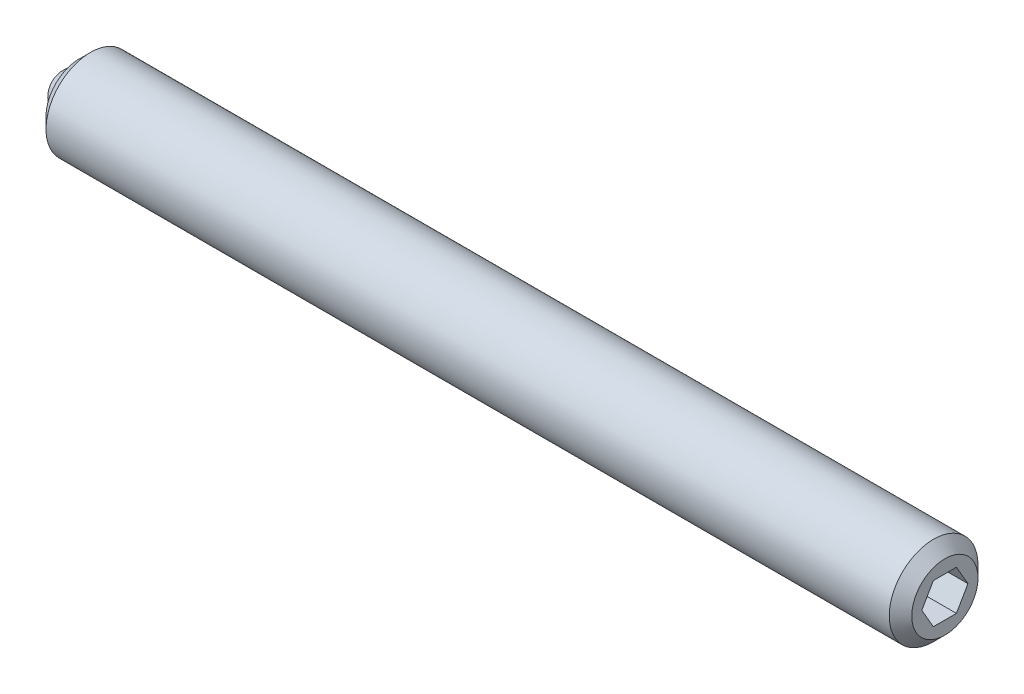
ISO-10303-21;
HEADER;
FILE_DESCRIPTION(('STEP AP214'),'2;1');
FILE_NAME('part.step','',(''),(''),'','','');
FILE_SCHEMA(('AUTOMOTIVE_DESIGN { 1 0 10303 214 1 1 1 1 }'));
ENDSEC;
DATA;
#1=APPLICATION_CONTEXT('core data for automotive mechanical design processes');
#2=APPLICATION_PROTOCOL_DEFINITION('international standard','automotive_design',2000,#1);
#3=PRODUCT_CONTEXT('',#1,'mechanical');
#4=PRODUCT('Part','Part','',(#3));
#5=PRODUCT_RELATED_PRODUCT_CATEGORY('part','',(#4));
#6=PRODUCT_DEFINITION_FORMATION('','',#4);
#7=PRODUCT_DEFINITION_CONTEXT('part definition',#1,'design');
#8=PRODUCT_DEFINITION('design','',#6,#7);
#9=PRODUCT_DEFINITION_SHAPE('','',#8);
#10=(LENGTH_UNIT() NAMED_UNIT(*) SI_UNIT(.MILLI.,.METRE.));
#11=(NAMED_UNIT(*) PLANE_ANGLE_UNIT() SI_UNIT($,.RADIAN.));
#12=(NAMED_UNIT(*) SI_UNIT($,.STERADIAN.) SOLID_ANGLE_UNIT());
#13=UNCERTAINTY_MEASURE_WITH_UNIT(LENGTH_MEASURE(1.E-05),#10,'distance_accuracy_value','');
#14=(GEOMETRIC_REPRESENTATION_CONTEXT(3) GLOBAL_UNCERTAINTY_ASSIGNED_CONTEXT((#13)) GLOBAL_UNIT_ASSIGNED_CONTEXT((#10,
#11,#12)) REPRESENTATION_CONTEXT('',''));
#15=CARTESIAN_POINT('',(0.,0.,0.));
#16=DIRECTION('',(0.,0.,1.));
#17=DIRECTION('',(1.,0.,0.));
#18=AXIS2_PLACEMENT_3D('',#15,#16,#17);
#19=CARTESIAN_POINT('',(0.,0.,0.));
#20=DIRECTION('',(0.,-1.,0.));
#21=DIRECTION('',(0.,0.,-1.));
#22=AXIS2_PLACEMENT_3D('',#19,#20,#21);
#23=SPHERICAL_SURFACE('',#22,0.5);
#24=CARTESIAN_POINT('',(0.,-0.5,0.));
#25=VERTEX_POINT('',#24);
#26=VERTEX_LOOP('',#25);
#27=FACE_BOUND('',#26,.T.);
#28=ADVANCED_FACE('F41',(#27),#23,.T.);
#29=CLOSED_SHELL('',(#28));
#30=MANIFOLD_SOLID_BREP('B2',#29);
#31=CARTESIAN_POINT('',(19.5,0.,0.));
#32=DIRECTION('',(-1.,0.,0.));
#33=DIRECTION('',(0.,0.,1.));
#34=AXIS2_PLACEMENT_3D('',#31,#32,#33);
#35=CYLINDRICAL_SURFACE('',#34,1.);
#36=CARTESIAN_POINT('',(19.246,0.,0.));
#37=DIRECTION('',(1.,0.,0.));
#38=DIRECTION('',(0.,0.,-1.));
#39=AXIS2_PLACEMENT_3D('',#36,#37,#38);
#40=CIRCLE('',#39,1.);
#41=CARTESIAN_POINT('',(19.246,0.,-1.));
#42=VERTEX_POINT('',#41);
#43=EDGE_CURVE('E39',#42,#42,#40,.F.);
#44=ORIENTED_EDGE('',*,*,#43,.T.);
#45=EDGE_LOOP('',(#44));
#46=FACE_BOUND('',#45,.T.);
#47=CARTESIAN_POINT('',(0.253999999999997,0.,0.));
#48=DIRECTION('',(1.,0.,0.));
#49=DIRECTION('',(0.,0.,-1.));
#50=AXIS2_PLACEMENT_3D('',#47,#48,#49);
#51=CIRCLE('',#50,1.);
#52=CARTESIAN_POINT('',(0.253999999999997,0.,-1.));
#53=VERTEX_POINT('',#52);
#54=EDGE_CURVE('E157',#53,#53,#51,.T.);
#55=ORIENTED_EDGE('',*,*,#54,.T.);
#56=EDGE_LOOP('',(#55));
#57=FACE_BOUND('',#56,.T.);
#58=ADVANCED_FACE('F54',(#46,#57),#35,.T.);
#59=CARTESIAN_POINT('',(19.5,0.,0.));
#60=DIRECTION('',(1.,0.,0.));
#61=DIRECTION('',(0.,0.,-1.));
#62=AXIS2_PLACEMENT_3D('',#59,#60,#61);
#63=PLANE('',#62);
#64=DIRECTION('',(0.,0.866025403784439,-0.5));
#65=VECTOR('',#64,1.);
#66=CARTESIAN_POINT('',(19.5,-0.45,-0.259807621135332));
#67=LINE('',#66,#65);
#68=CARTESIAN_POINT('',(19.5,-0.45,-0.259807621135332));
#69=VERTEX_POINT('',#68);
#70=CARTESIAN_POINT('',(19.5,0.,-0.519615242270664));
#71=VERTEX_POINT('',#70);
#72=EDGE_CURVE('E69',#69,#71,#67,.T.);
#73=ORIENTED_EDGE('',*,*,#72,.F.);
#74=DIRECTION('',(0.,0.,-1.));
#75=VECTOR('',#74,1.);
#76=CARTESIAN_POINT('',(19.5,-0.45,0.259807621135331));
#77=LINE('',#76,#75);
#78=CARTESIAN_POINT('',(19.5,-0.45,0.259807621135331));
#79=VERTEX_POINT('',#78);
#80=EDGE_CURVE('E153',#79,#69,#77,.T.);
#81=ORIENTED_EDGE('',*,*,#80,.F.);
#82=DIRECTION('',(0.,-0.866025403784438,-0.5));
#83=VECTOR('',#82,1.);
#84=CARTESIAN_POINT('',(19.5,0.,0.519615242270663));
#85=LINE('',#84,#83);
#86=CARTESIAN_POINT('',(19.5,0.,0.519615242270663));
#87=VERTEX_POINT('',#86);
#88=EDGE_CURVE('E151',#87,#79,#85,.T.);
#89=ORIENTED_EDGE('',*,*,#88,.F.);
#90=DIRECTION('',(0.,-0.866025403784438,0.5));
#91=VECTOR('',#90,1.);
#92=CARTESIAN_POINT('',(19.5,0.45,0.259807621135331));
#93=LINE('',#92,#91);
#94=CARTESIAN_POINT('',(19.5,0.45,0.259807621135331));
#95=VERTEX_POINT('',#94);
#96=EDGE_CURVE('E117',#95,#87,#93,.T.);
#97=ORIENTED_EDGE('',*,*,#96,.F.);
#98=DIRECTION('',(0.,0.,1.));
#99=VECTOR('',#98,1.);
#100=CARTESIAN_POINT('',(19.5,0.45,-0.259807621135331));
#101=LINE('',#100,#99);
#102=CARTESIAN_POINT('',(19.5,0.45,-0.259807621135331));
#103=VERTEX_POINT('',#102);
#104=EDGE_CURVE('E147',#103,#95,#101,.T.);
#105=ORIENTED_EDGE('',*,*,#104,.F.);
#106=DIRECTION('',(0.,0.866025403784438,0.5));
#107=VECTOR('',#106,1.);
#108=CARTESIAN_POINT('',(19.5,0.,-0.519615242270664));
#109=LINE('',#108,#107);
#110=EDGE_CURVE('E143',#71,#103,#109,.T.);
#111=ORIENTED_EDGE('',*,*,#110,.F.);
#112=EDGE_LOOP('',(#73,#81,#89,#97,#105,#111));
#113=FACE_BOUND('',#112,.T.);
#114=CARTESIAN_POINT('',(19.5,0.,0.));
#115=DIRECTION('',(1.,0.,0.));
#116=DIRECTION('',(0.,0.,-1.));
#117=AXIS2_PLACEMENT_3D('',#114,#115,#116);
#118=CIRCLE('',#117,0.746);
#119=CARTESIAN_POINT('',(19.5,0.,-0.746));
#120=VERTEX_POINT('',#119);
#121=EDGE_CURVE('E62',#120,#120,#118,.T.);
#122=ORIENTED_EDGE('',*,*,#121,.T.);
#123=EDGE_LOOP('',(#122));
#124=FACE_BOUND('',#123,.T.);
#125=ADVANCED_FACE('F170',(#113,#124),#63,.T.);
#126=CARTESIAN_POINT('',(0.,0.,0.));
#127=DIRECTION('',(1.,0.,0.));
#128=DIRECTION('',(0.,0.,-1.));
#129=AXIS2_PLACEMENT_3D('',#126,#127,#128);
#130=PLANE('',#129);
#131=CARTESIAN_POINT('',(0.,0.,0.));
#132=DIRECTION('',(-1.,0.,0.));
#133=DIRECTION('',(0.,0.,1.));
#134=AXIS2_PLACEMENT_3D('',#131,#132,#133);
#135=CIRCLE('',#134,0.5);
#136=CARTESIAN_POINT('',(0.,0.,0.5));
#137=VERTEX_POINT('',#136);
#138=EDGE_CURVE('E225',#137,#137,#135,.T.);
#139=ORIENTED_EDGE('',*,*,#138,.F.);
#140=EDGE_LOOP('',(#139));
#141=FACE_BOUND('',#140,.T.);
#142=CARTESIAN_POINT('',(0.,0.,0.));
#143=DIRECTION('',(1.,0.,0.));
#144=DIRECTION('',(0.,0.,-1.));
#145=AXIS2_PLACEMENT_3D('',#142,#143,#144);
#146=CIRCLE('',#145,0.746000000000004);
#147=CARTESIAN_POINT('',(0.,0.,-0.746000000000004));
#148=VERTEX_POINT('',#147);
#149=EDGE_CURVE('E165',#148,#148,#146,.F.);
#150=ORIENTED_EDGE('',*,*,#149,.T.);
#151=EDGE_LOOP('',(#150));
#152=FACE_BOUND('',#151,.T.);
#153=ADVANCED_FACE('F182',(#141,#152),#130,.F.);
#154=CARTESIAN_POINT('',(0.253999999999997,0.,0.));
#155=DIRECTION('',(1.,0.,0.));
#156=DIRECTION('',(0.,0.,-1.));
#157=AXIS2_PLACEMENT_3D('',#154,#155,#156);
#158=CONICAL_SURFACE('',#157,1.,0.785398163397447);
#159=ORIENTED_EDGE('',*,*,#149,.F.);
#160=EDGE_LOOP('',(#159));
#161=FACE_BOUND('',#160,.T.);
#162=ORIENTED_EDGE('',*,*,#54,.F.);
#163=EDGE_LOOP('',(#162));
#164=FACE_BOUND('',#163,.T.);
#165=ADVANCED_FACE('F174',(#161,#164),#158,.T.);
#166=CARTESIAN_POINT('',(19.5,0.,0.));
#167=DIRECTION('',(-1.,0.,0.));
#168=DIRECTION('',(0.,0.,1.));
#169=AXIS2_PLACEMENT_3D('',#166,#167,#168);
#170=CONICAL_SURFACE('',#169,0.746,0.785398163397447);
#171=ORIENTED_EDGE('',*,*,#43,.F.);
#172=EDGE_LOOP('',(#171));
#173=FACE_BOUND('',#172,.T.);
#174=ORIENTED_EDGE('',*,*,#121,.F.);
#175=EDGE_LOOP('',(#174));
#176=FACE_BOUND('',#175,.T.);
#177=ADVANCED_FACE('F56',(#173,#176),#170,.T.);
#178=CARTESIAN_POINT('',(17.5,-0.45,-0.259807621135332));
#179=DIRECTION('',(0.,-0.5,-0.866025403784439));
#180=DIRECTION('',(0.,0.866025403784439,-0.5));
#181=AXIS2_PLACEMENT_3D('',#178,#179,#180);
#182=PLANE('',#181);
#183=ORIENTED_EDGE('',*,*,#72,.T.);
#184=DIRECTION('',(1.,0.,0.));
#185=VECTOR('',#184,1.);
#186=CARTESIAN_POINT('',(17.5,0.,-0.519615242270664));
#187=LINE('',#186,#185);
#188=CARTESIAN_POINT('',(17.5,0.,-0.519615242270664));
#189=VERTEX_POINT('',#188);
#190=EDGE_CURVE('E99',#189,#71,#187,.T.);
#191=ORIENTED_EDGE('',*,*,#190,.F.);
#192=DIRECTION('',(0.,0.866025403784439,-0.5));
#193=VECTOR('',#192,1.);
#194=CARTESIAN_POINT('',(17.5,-0.45,-0.259807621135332));
#195=LINE('',#194,#193);
#196=CARTESIAN_POINT('',(17.5,-0.45,-0.259807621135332));
#197=VERTEX_POINT('',#196);
#198=EDGE_CURVE('E155',#197,#189,#195,.T.);
#199=ORIENTED_EDGE('',*,*,#198,.F.);
#200=DIRECTION('',(1.,0.,0.));
#201=VECTOR('',#200,1.);
#202=CARTESIAN_POINT('',(17.5,-0.45,-0.259807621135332));
#203=LINE('',#202,#201);
#204=EDGE_CURVE('E77',#197,#69,#203,.T.);
#205=ORIENTED_EDGE('',*,*,#204,.T.);
#206=EDGE_LOOP('',(#183,#191,#199,#205));
#207=FACE_BOUND('',#206,.T.);
#208=ADVANCED_FACE('F173',(#207),#182,.F.);
#209=CARTESIAN_POINT('',(17.5,-0.45,0.259807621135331));
#210=DIRECTION('',(0.,-1.,0.));
#211=DIRECTION('',(0.,0.,-1.));
#212=AXIS2_PLACEMENT_3D('',#209,#210,#211);
#213=PLANE('',#212);
#214=ORIENTED_EDGE('',*,*,#80,.T.);
#215=ORIENTED_EDGE('',*,*,#204,.F.);
#216=DIRECTION('',(0.,0.,-1.));
#217=VECTOR('',#216,1.);
#218=CARTESIAN_POINT('',(17.5,-0.45,0.259807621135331));
#219=LINE('',#218,#217);
#220=CARTESIAN_POINT('',(17.5,-0.45,0.259807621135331));
#221=VERTEX_POINT('',#220);
#222=EDGE_CURVE('E129',#221,#197,#219,.T.);
#223=ORIENTED_EDGE('',*,*,#222,.F.);
#224=DIRECTION('',(1.,0.,0.));
#225=VECTOR('',#224,1.);
#226=CARTESIAN_POINT('',(17.5,-0.45,0.259807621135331));
#227=LINE('',#226,#225);
#228=EDGE_CURVE('E121',#221,#79,#227,.T.);
#229=ORIENTED_EDGE('',*,*,#228,.T.);
#230=EDGE_LOOP('',(#214,#215,#223,#229));
#231=FACE_BOUND('',#230,.T.);
#232=ADVANCED_FACE('F180',(#231),#213,.F.);
#233=CARTESIAN_POINT('',(17.5,0.,0.519615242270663));
#234=DIRECTION('',(0.,-0.5,0.866025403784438));
#235=DIRECTION('',(0.,-0.866025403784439,-0.5));
#236=AXIS2_PLACEMENT_3D('',#233,#234,#235);
#237=PLANE('',#236);
#238=ORIENTED_EDGE('',*,*,#88,.T.);
#239=ORIENTED_EDGE('',*,*,#228,.F.);
#240=DIRECTION('',(0.,-0.866025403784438,-0.5));
#241=VECTOR('',#240,1.);
#242=CARTESIAN_POINT('',(17.5,0.,0.519615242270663));
#243=LINE('',#242,#241);
#244=CARTESIAN_POINT('',(17.5,0.,0.519615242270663));
#245=VERTEX_POINT('',#244);
#246=EDGE_CURVE('E125',#245,#221,#243,.T.);
#247=ORIENTED_EDGE('',*,*,#246,.F.);
#248=DIRECTION('',(1.,0.,0.));
#249=VECTOR('',#248,1.);
#250=CARTESIAN_POINT('',(17.5,0.,0.519615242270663));
#251=LINE('',#250,#249);
#252=EDGE_CURVE('E110',#245,#87,#251,.T.);
#253=ORIENTED_EDGE('',*,*,#252,.T.);
#254=EDGE_LOOP('',(#238,#239,#247,#253));
#255=FACE_BOUND('',#254,.T.);
#256=ADVANCED_FACE('F126',(#255),#237,.F.);
#257=CARTESIAN_POINT('',(17.5,0.45,0.259807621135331));
#258=DIRECTION('',(0.,0.5,0.866025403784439));
#259=DIRECTION('',(0.,-0.866025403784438,0.5));
#260=AXIS2_PLACEMENT_3D('',#257,#258,#259);
#261=PLANE('',#260);
#262=ORIENTED_EDGE('',*,*,#96,.T.);
#263=ORIENTED_EDGE('',*,*,#252,.F.);
#264=DIRECTION('',(0.,-0.866025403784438,0.5));
#265=VECTOR('',#264,1.);
#266=CARTESIAN_POINT('',(17.5,0.45,0.259807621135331));
#267=LINE('',#266,#265);
#268=CARTESIAN_POINT('',(17.5,0.45,0.259807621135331));
#269=VERTEX_POINT('',#268);
#270=EDGE_CURVE('E114',#269,#245,#267,.T.);
#271=ORIENTED_EDGE('',*,*,#270,.F.);
#272=DIRECTION('',(1.,0.,0.));
#273=VECTOR('',#272,1.);
#274=CARTESIAN_POINT('',(17.5,0.45,0.259807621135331));
#275=LINE('',#274,#273);
#276=EDGE_CURVE('E122',#269,#95,#275,.T.);
#277=ORIENTED_EDGE('',*,*,#276,.T.);
#278=EDGE_LOOP('',(#262,#263,#271,#277));
#279=FACE_BOUND('',#278,.T.);
#280=ADVANCED_FACE('F112',(#279),#261,.F.);
#281=CARTESIAN_POINT('',(17.5,0.45,-0.259807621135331));
#282=DIRECTION('',(0.,1.,0.));
#283=DIRECTION('',(0.,0.,1.));
#284=AXIS2_PLACEMENT_3D('',#281,#282,#283);
#285=PLANE('',#284);
#286=ORIENTED_EDGE('',*,*,#104,.T.);
#287=ORIENTED_EDGE('',*,*,#276,.F.);
#288=DIRECTION('',(0.,0.,1.));
#289=VECTOR('',#288,1.);
#290=CARTESIAN_POINT('',(17.5,0.45,-0.259807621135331));
#291=LINE('',#290,#289);
#292=CARTESIAN_POINT('',(17.5,0.45,-0.259807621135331));
#293=VERTEX_POINT('',#292);
#294=EDGE_CURVE('E135',#293,#269,#291,.T.);
#295=ORIENTED_EDGE('',*,*,#294,.F.);
#296=DIRECTION('',(1.,0.,0.));
#297=VECTOR('',#296,1.);
#298=CARTESIAN_POINT('',(17.5,0.45,-0.259807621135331));
#299=LINE('',#298,#297);
#300=EDGE_CURVE('E160',#293,#103,#299,.T.);
#301=ORIENTED_EDGE('',*,*,#300,.T.);
#302=EDGE_LOOP('',(#286,#287,#295,#301));
#303=FACE_BOUND('',#302,.T.);
#304=ADVANCED_FACE('F201',(#303),#285,.F.);
#305=CARTESIAN_POINT('',(17.5,0.,-0.519615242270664));
#306=DIRECTION('',(0.,0.5,-0.866025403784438));
#307=DIRECTION('',(0.,0.866025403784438,0.5));
#308=AXIS2_PLACEMENT_3D('',#305,#306,#307);
#309=PLANE('',#308);
#310=ORIENTED_EDGE('',*,*,#110,.T.);
#311=ORIENTED_EDGE('',*,*,#300,.F.);
#312=DIRECTION('',(0.,0.866025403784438,0.5));
#313=VECTOR('',#312,1.);
#314=CARTESIAN_POINT('',(17.5,0.,-0.519615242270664));
#315=LINE('',#314,#313);
#316=EDGE_CURVE('E137',#189,#293,#315,.T.);
#317=ORIENTED_EDGE('',*,*,#316,.F.);
#318=ORIENTED_EDGE('',*,*,#190,.T.);
#319=EDGE_LOOP('',(#310,#311,#317,#318));
#320=FACE_BOUND('',#319,.T.);
#321=ADVANCED_FACE('F198',(#320),#309,.F.);
#322=CARTESIAN_POINT('',(17.5,0.,0.));
#323=DIRECTION('',(1.,0.,0.));
#324=DIRECTION('',(0.,0.,-1.));
#325=AXIS2_PLACEMENT_3D('',#322,#323,#324);
#326=PLANE('',#325);
#327=ORIENTED_EDGE('',*,*,#198,.T.);
#328=ORIENTED_EDGE('',*,*,#316,.T.);
#329=ORIENTED_EDGE('',*,*,#294,.T.);
#330=ORIENTED_EDGE('',*,*,#270,.T.);
#331=ORIENTED_EDGE('',*,*,#246,.T.);
#332=ORIENTED_EDGE('',*,*,#222,.T.);
#333=EDGE_LOOP('',(#327,#328,#329,#330,#331,#332));
#334=FACE_BOUND('',#333,.T.);
#335=ADVANCED_FACE('F132',(#334),#326,.T.);
#336=CARTESIAN_POINT('',(0.5,0.,0.));
#337=DIRECTION('',(-1.,0.,0.));
#338=DIRECTION('',(0.,0.,1.));
#339=AXIS2_PLACEMENT_3D('',#336,#337,#338);
#340=CYLINDRICAL_SURFACE('',#339,0.5);
#341=CARTESIAN_POINT('',(0.5,0.,0.));
#342=DIRECTION('',(-1.,0.,0.));
#343=DIRECTION('',(0.,0.,1.));
#344=AXIS2_PLACEMENT_3D('',#341,#342,#343);
#345=CIRCLE('',#344,0.5);
#346=CARTESIAN_POINT('',(0.5,0.,0.5));
#347=VERTEX_POINT('',#346);
#348=EDGE_CURVE('E144',#347,#347,#345,.T.);
#349=ORIENTED_EDGE('',*,*,#348,.F.);
#350=EDGE_LOOP('',(#349));
#351=FACE_BOUND('',#350,.T.);
#352=ORIENTED_EDGE('',*,*,#138,.T.);
#353=EDGE_LOOP('',(#352));
#354=FACE_BOUND('',#353,.T.);
#355=ADVANCED_FACE('F214',(#351,#354),#340,.F.);
#356=CARTESIAN_POINT('',(0.5,0.,0.));
#357=DIRECTION('',(-1.,0.,0.));
#358=DIRECTION('',(0.,0.,1.));
#359=AXIS2_PLACEMENT_3D('',#356,#357,#358);
#360=PLANE('',#359);
#361=ORIENTED_EDGE('',*,*,#348,.T.);
#362=EDGE_LOOP('',(#361));
#363=FACE_BOUND('',#362,.T.);
#364=ADVANCED_FACE('F217',(#363),#360,.T.);
#365=CLOSED_SHELL('',(#58,#125,#153,#165,#177,#208,#232,#256,#280,#304,#321,#335,#355,#364));
#366=MANIFOLD_SOLID_BREP('B6',#365);
#367=ADVANCED_BREP_SHAPE_REPRESENTATION('',(#18,#30,#366),#14);
#368=SHAPE_DEFINITION_REPRESENTATION(#9,#367);
ENDSEC;
END-ISO-10303-21;
